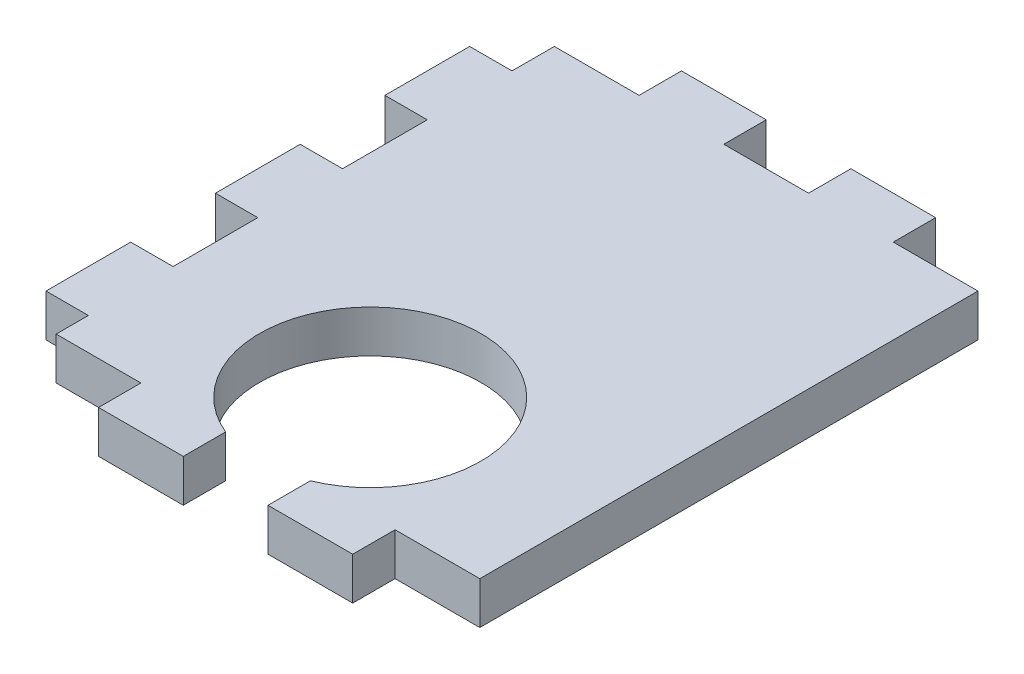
ISO-10303-21;
HEADER;
FILE_DESCRIPTION(('STEP AP214'),'2;1');
FILE_NAME('part.step','',(''),(''),'','','');
FILE_SCHEMA(('AUTOMOTIVE_DESIGN { 1 0 10303 214 1 1 1 1 }'));
ENDSEC;
DATA;
#1=APPLICATION_CONTEXT('core data for automotive mechanical design processes');
#2=APPLICATION_PROTOCOL_DEFINITION('international standard','automotive_design',2000,#1);
#3=PRODUCT_CONTEXT('',#1,'mechanical');
#4=PRODUCT('Part','Part','',(#3));
#5=PRODUCT_RELATED_PRODUCT_CATEGORY('part','',(#4));
#6=PRODUCT_DEFINITION_FORMATION('','',#4);
#7=PRODUCT_DEFINITION_CONTEXT('part definition',#1,'design');
#8=PRODUCT_DEFINITION('design','',#6,#7);
#9=PRODUCT_DEFINITION_SHAPE('','',#8);
#10=(LENGTH_UNIT() NAMED_UNIT(*) SI_UNIT(.MILLI.,.METRE.));
#11=(NAMED_UNIT(*) PLANE_ANGLE_UNIT() SI_UNIT($,.RADIAN.));
#12=(NAMED_UNIT(*) SI_UNIT($,.STERADIAN.) SOLID_ANGLE_UNIT());
#13=UNCERTAINTY_MEASURE_WITH_UNIT(LENGTH_MEASURE(1.E-05),#10,'distance_accuracy_value','');
#14=(GEOMETRIC_REPRESENTATION_CONTEXT(3) GLOBAL_UNCERTAINTY_ASSIGNED_CONTEXT((#13)) GLOBAL_UNIT_ASSIGNED_CONTEXT((#10,
#11,#12)) REPRESENTATION_CONTEXT('',''));
#15=CARTESIAN_POINT('',(0.,0.,0.));
#16=DIRECTION('',(0.,0.,1.));
#17=DIRECTION('',(1.,0.,0.));
#18=AXIS2_PLACEMENT_3D('',#15,#16,#17);
#19=CARTESIAN_POINT('',(0.,3.175,0.));
#20=DIRECTION('',(0.,-1.,0.));
#21=DIRECTION('',(0.,0.,-1.));
#22=AXIS2_PLACEMENT_3D('',#19,#20,#21);
#23=PLANE('',#22);
#24=CARTESIAN_POINT('',(19.05,3.175,-10.8366787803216));
#25=DIRECTION('',(0.,1.,0.));
#26=DIRECTION('',(0.,0.,1.));
#27=AXIS2_PLACEMENT_3D('',#24,#25,#26);
#28=CIRCLE('',#27,8.29348821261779);
#29=CARTESIAN_POINT('',(15.875,3.175,-3.175));
#30=VERTEX_POINT('',#29);
#31=CARTESIAN_POINT('',(22.225,3.175,-3.175));
#32=VERTEX_POINT('',#31);
#33=EDGE_CURVE('E42',#30,#32,#28,.F.);
#34=ORIENTED_EDGE('',*,*,#33,.T.);
#35=DIRECTION('',(0.,0.,-1.));
#36=VECTOR('',#35,1.);
#37=CARTESIAN_POINT('',(22.225,3.175,0.));
#38=LINE('',#37,#36);
#39=CARTESIAN_POINT('',(22.225,3.175,0.));
#40=VERTEX_POINT('',#39);
#41=EDGE_CURVE('E187',#40,#32,#38,.T.);
#42=ORIENTED_EDGE('',*,*,#41,.F.);
#43=DIRECTION('',(1.,0.,0.));
#44=VECTOR('',#43,1.);
#45=CARTESIAN_POINT('',(0.,3.175,0.));
#46=LINE('',#45,#44);
#47=CARTESIAN_POINT('',(28.575,3.175,0.));
#48=VERTEX_POINT('',#47);
#49=EDGE_CURVE('E232',#40,#48,#46,.T.);
#50=ORIENTED_EDGE('',*,*,#49,.T.);
#51=DIRECTION('',(0.,0.,1.));
#52=VECTOR('',#51,1.);
#53=CARTESIAN_POINT('',(28.575,3.175,0.));
#54=LINE('',#53,#52);
#55=CARTESIAN_POINT('',(28.575,3.175,-3.175));
#56=VERTEX_POINT('',#55);
#57=EDGE_CURVE('E209',#56,#48,#54,.T.);
#58=ORIENTED_EDGE('',*,*,#57,.F.);
#59=DIRECTION('',(-1.,0.,0.));
#60=VECTOR('',#59,1.);
#61=CARTESIAN_POINT('',(28.575,3.175,-3.175));
#62=LINE('',#61,#60);
#63=CARTESIAN_POINT('',(34.925,3.175,-3.175));
#64=VERTEX_POINT('',#63);
#65=EDGE_CURVE('E214',#64,#56,#62,.T.);
#66=ORIENTED_EDGE('',*,*,#65,.F.);
#67=DIRECTION('',(0.,0.,-1.));
#68=VECTOR('',#67,1.);
#69=CARTESIAN_POINT('',(34.925,3.175,0.));
#70=LINE('',#69,#68);
#71=CARTESIAN_POINT('',(34.925,3.175,-40.513));
#72=VERTEX_POINT('',#71);
#73=EDGE_CURVE('E227',#64,#72,#70,.T.);
#74=ORIENTED_EDGE('',*,*,#73,.T.);
#75=DIRECTION('',(1.,0.,0.));
#76=VECTOR('',#75,1.);
#77=CARTESIAN_POINT('',(28.575,3.175,-40.513));
#78=LINE('',#77,#76);
#79=CARTESIAN_POINT('',(28.575,3.175,-40.513));
#80=VERTEX_POINT('',#79);
#81=EDGE_CURVE('E197',#80,#72,#78,.T.);
#82=ORIENTED_EDGE('',*,*,#81,.F.);
#83=DIRECTION('',(0.,0.,1.));
#84=VECTOR('',#83,1.);
#85=CARTESIAN_POINT('',(28.575,3.175,-43.688));
#86=LINE('',#85,#84);
#87=CARTESIAN_POINT('',(28.575,3.175,-43.688));
#88=VERTEX_POINT('',#87);
#89=EDGE_CURVE('E184',#88,#80,#86,.T.);
#90=ORIENTED_EDGE('',*,*,#89,.F.);
#91=DIRECTION('',(-1.,0.,0.));
#92=VECTOR('',#91,1.);
#93=CARTESIAN_POINT('',(0.,3.175,-43.688));
#94=LINE('',#93,#92);
#95=CARTESIAN_POINT('',(22.225,3.175,-43.688));
#96=VERTEX_POINT('',#95);
#97=EDGE_CURVE('E12',#88,#96,#94,.T.);
#98=ORIENTED_EDGE('',*,*,#97,.T.);
#99=DIRECTION('',(0.,0.,-1.));
#100=VECTOR('',#99,1.);
#101=CARTESIAN_POINT('',(22.225,3.175,-43.688));
#102=LINE('',#101,#100);
#103=CARTESIAN_POINT('',(22.225,3.175,-40.513));
#104=VERTEX_POINT('',#103);
#105=EDGE_CURVE('E398',#104,#96,#102,.T.);
#106=ORIENTED_EDGE('',*,*,#105,.F.);
#107=DIRECTION('',(1.,0.,0.));
#108=VECTOR('',#107,1.);
#109=CARTESIAN_POINT('',(15.875,3.175,-40.513));
#110=LINE('',#109,#108);
#111=CARTESIAN_POINT('',(15.875,3.175,-40.513));
#112=VERTEX_POINT('',#111);
#113=EDGE_CURVE('E404',#112,#104,#110,.T.);
#114=ORIENTED_EDGE('',*,*,#113,.F.);
#115=DIRECTION('',(0.,0.,1.));
#116=VECTOR('',#115,1.);
#117=CARTESIAN_POINT('',(15.875,3.175,-43.688));
#118=LINE('',#117,#116);
#119=CARTESIAN_POINT('',(15.875,3.175,-43.688));
#120=VERTEX_POINT('',#119);
#121=EDGE_CURVE('E378',#120,#112,#118,.T.);
#122=ORIENTED_EDGE('',*,*,#121,.F.);
#123=CARTESIAN_POINT('',(9.52499999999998,3.175,-43.688));
#124=VERTEX_POINT('',#123);
#125=EDGE_CURVE('E48',#120,#124,#94,.T.);
#126=ORIENTED_EDGE('',*,*,#125,.T.);
#127=DIRECTION('',(0.,0.,-1.));
#128=VECTOR('',#127,1.);
#129=CARTESIAN_POINT('',(9.52499999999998,3.175,-43.688));
#130=LINE('',#129,#128);
#131=CARTESIAN_POINT('',(9.52499999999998,3.175,-40.513));
#132=VERTEX_POINT('',#131);
#133=EDGE_CURVE('E251',#132,#124,#130,.T.);
#134=ORIENTED_EDGE('',*,*,#133,.F.);
#135=DIRECTION('',(1.,0.,0.));
#136=VECTOR('',#135,1.);
#137=CARTESIAN_POINT('',(3.175,3.175,-40.513));
#138=LINE('',#137,#136);
#139=CARTESIAN_POINT('',(3.175,3.175,-40.513));
#140=VERTEX_POINT('',#139);
#141=EDGE_CURVE('E257',#140,#132,#138,.T.);
#142=ORIENTED_EDGE('',*,*,#141,.F.);
#143=DIRECTION('',(0.,0.,1.));
#144=VECTOR('',#143,1.);
#145=CARTESIAN_POINT('',(3.1750000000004,3.175,0.));
#146=LINE('',#145,#144);
#147=CARTESIAN_POINT('',(3.17500000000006,3.175,-37.338));
#148=VERTEX_POINT('',#147);
#149=EDGE_CURVE('E345',#140,#148,#146,.T.);
#150=ORIENTED_EDGE('',*,*,#149,.T.);
#151=DIRECTION('',(1.,0.,0.));
#152=VECTOR('',#151,1.);
#153=CARTESIAN_POINT('',(0.,3.175,-37.338));
#154=LINE('',#153,#152);
#155=CARTESIAN_POINT('',(0.,3.175,-37.338));
#156=VERTEX_POINT('',#155);
#157=EDGE_CURVE('E352',#156,#148,#154,.T.);
#158=ORIENTED_EDGE('',*,*,#157,.F.);
#159=DIRECTION('',(0.,0.,1.));
#160=VECTOR('',#159,1.);
#161=CARTESIAN_POINT('',(0.,3.175,0.));
#162=LINE('',#161,#160);
#163=CARTESIAN_POINT('',(0.,3.175,-30.988));
#164=VERTEX_POINT('',#163);
#165=EDGE_CURVE('E276',#156,#164,#162,.T.);
#166=ORIENTED_EDGE('',*,*,#165,.T.);
#167=DIRECTION('',(1.,0.,0.));
#168=VECTOR('',#167,1.);
#169=CARTESIAN_POINT('',(0.,3.175,-30.988));
#170=LINE('',#169,#168);
#171=CARTESIAN_POINT('',(3.17500000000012,3.175,-30.988));
#172=VERTEX_POINT('',#171);
#173=EDGE_CURVE('E563',#164,#172,#170,.T.);
#174=ORIENTED_EDGE('',*,*,#173,.T.);
#175=DIRECTION('',(0.,0.,1.));
#176=VECTOR('',#175,1.);
#177=CARTESIAN_POINT('',(3.1750000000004,3.175,0.));
#178=LINE('',#177,#176);
#179=CARTESIAN_POINT('',(3.17500000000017,3.175,-24.638));
#180=VERTEX_POINT('',#179);
#181=EDGE_CURVE('E568',#172,#180,#178,.T.);
#182=ORIENTED_EDGE('',*,*,#181,.T.);
#183=DIRECTION('',(1.,0.,0.));
#184=VECTOR('',#183,1.);
#185=CARTESIAN_POINT('',(0.,3.175,-24.638));
#186=LINE('',#185,#184);
#187=CARTESIAN_POINT('',(0.,3.175,-24.638));
#188=VERTEX_POINT('',#187);
#189=EDGE_CURVE('E573',#188,#180,#186,.T.);
#190=ORIENTED_EDGE('',*,*,#189,.F.);
#191=CARTESIAN_POINT('',(0.,3.175,-18.288));
#192=VERTEX_POINT('',#191);
#193=EDGE_CURVE('E280',#188,#192,#162,.T.);
#194=ORIENTED_EDGE('',*,*,#193,.T.);
#195=DIRECTION('',(1.,0.,0.));
#196=VECTOR('',#195,1.);
#197=CARTESIAN_POINT('',(0.,3.175,-18.288));
#198=LINE('',#197,#196);
#199=CARTESIAN_POINT('',(3.17500000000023,3.175,-18.288));
#200=VERTEX_POINT('',#199);
#201=EDGE_CURVE('E297',#192,#200,#198,.T.);
#202=ORIENTED_EDGE('',*,*,#201,.T.);
#203=DIRECTION('',(0.,0.,1.));
#204=VECTOR('',#203,1.);
#205=CARTESIAN_POINT('',(3.1750000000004,3.175,0.));
#206=LINE('',#205,#204);
#207=CARTESIAN_POINT('',(3.17500000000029,3.175,-11.938));
#208=VERTEX_POINT('',#207);
#209=EDGE_CURVE('E305',#200,#208,#206,.T.);
#210=ORIENTED_EDGE('',*,*,#209,.T.);
#211=DIRECTION('',(1.,0.,0.));
#212=VECTOR('',#211,1.);
#213=CARTESIAN_POINT('',(0.,3.175,-11.938));
#214=LINE('',#213,#212);
#215=CARTESIAN_POINT('',(0.,3.175,-11.938));
#216=VERTEX_POINT('',#215);
#217=EDGE_CURVE('E311',#216,#208,#214,.T.);
#218=ORIENTED_EDGE('',*,*,#217,.F.);
#219=CARTESIAN_POINT('',(0.,3.175,-5.58800000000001));
#220=VERTEX_POINT('',#219);
#221=EDGE_CURVE('E281',#216,#220,#162,.T.);
#222=ORIENTED_EDGE('',*,*,#221,.T.);
#223=DIRECTION('',(1.,0.,0.));
#224=VECTOR('',#223,1.);
#225=CARTESIAN_POINT('',(0.,3.175,-5.588));
#226=LINE('',#225,#224);
#227=CARTESIAN_POINT('',(3.17500000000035,3.175,-5.58800000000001));
#228=VERTEX_POINT('',#227);
#229=EDGE_CURVE('E324',#220,#228,#226,.T.);
#230=ORIENTED_EDGE('',*,*,#229,.T.);
#231=DIRECTION('',(0.,0.,-1.));
#232=VECTOR('',#231,1.);
#233=CARTESIAN_POINT('',(3.17499999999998,3.175,0.));
#234=LINE('',#233,#232);
#235=CARTESIAN_POINT('',(3.175,3.175,-3.175));
#236=VERTEX_POINT('',#235);
#237=EDGE_CURVE('E331',#236,#228,#234,.T.);
#238=ORIENTED_EDGE('',*,*,#237,.F.);
#239=DIRECTION('',(-1.,0.,0.));
#240=VECTOR('',#239,1.);
#241=CARTESIAN_POINT('',(3.175,3.175,-3.175));
#242=LINE('',#241,#240);
#243=CARTESIAN_POINT('',(9.52499999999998,3.175,-3.175));
#244=VERTEX_POINT('',#243);
#245=EDGE_CURVE('E429',#244,#236,#242,.T.);
#246=ORIENTED_EDGE('',*,*,#245,.F.);
#247=DIRECTION('',(0.,0.,-1.));
#248=VECTOR('',#247,1.);
#249=CARTESIAN_POINT('',(9.52499999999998,3.175,0.));
#250=LINE('',#249,#248);
#251=CARTESIAN_POINT('',(9.52499999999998,3.175,0.));
#252=VERTEX_POINT('',#251);
#253=EDGE_CURVE('E428',#252,#244,#250,.T.);
#254=ORIENTED_EDGE('',*,*,#253,.F.);
#255=CARTESIAN_POINT('',(15.875,3.175,0.));
#256=VERTEX_POINT('',#255);
#257=EDGE_CURVE('E231',#252,#256,#46,.T.);
#258=ORIENTED_EDGE('',*,*,#257,.T.);
#259=DIRECTION('',(0.,0.,1.));
#260=VECTOR('',#259,1.);
#261=CARTESIAN_POINT('',(15.875,3.175,0.));
#262=LINE('',#261,#260);
#263=EDGE_CURVE('E369',#30,#256,#262,.T.);
#264=ORIENTED_EDGE('',*,*,#263,.F.);
#265=EDGE_LOOP('',(#34,#42,#50,#58,#66,#74,#82,#90,#98,#106,#114,#122,#126,#134,#142,#150,#158,
#166,#174,#182,#190,#194,#202,#210,#218,#222,#230,#238,#246,#254,#258,#264));
#266=FACE_BOUND('',#265,.T.);
#267=ADVANCED_FACE('F38',(#266),#23,.F.);
#268=CARTESIAN_POINT('',(0.,0.,0.));
#269=DIRECTION('',(0.,-1.,0.));
#270=DIRECTION('',(0.,0.,-1.));
#271=AXIS2_PLACEMENT_3D('',#268,#269,#270);
#272=PLANE('',#271);
#273=DIRECTION('',(0.,0.,-1.));
#274=VECTOR('',#273,1.);
#275=CARTESIAN_POINT('',(22.225,0.,0.));
#276=LINE('',#275,#274);
#277=CARTESIAN_POINT('',(22.225,0.,0.));
#278=VERTEX_POINT('',#277);
#279=CARTESIAN_POINT('',(22.225,0.,-3.175));
#280=VERTEX_POINT('',#279);
#281=EDGE_CURVE('E82',#278,#280,#276,.T.);
#282=ORIENTED_EDGE('',*,*,#281,.T.);
#283=CARTESIAN_POINT('',(19.05,0.,-10.8366787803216));
#284=DIRECTION('',(0.,1.,0.));
#285=DIRECTION('',(0.,0.,1.));
#286=AXIS2_PLACEMENT_3D('',#283,#284,#285);
#287=CIRCLE('',#286,8.29348821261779);
#288=CARTESIAN_POINT('',(15.875,0.,-3.175));
#289=VERTEX_POINT('',#288);
#290=EDGE_CURVE('E612',#289,#280,#287,.F.);
#291=ORIENTED_EDGE('',*,*,#290,.F.);
#292=DIRECTION('',(0.,0.,1.));
#293=VECTOR('',#292,1.);
#294=CARTESIAN_POINT('',(15.875,0.,0.));
#295=LINE('',#294,#293);
#296=CARTESIAN_POINT('',(15.875,0.,0.));
#297=VERTEX_POINT('',#296);
#298=EDGE_CURVE('E370',#289,#297,#295,.T.);
#299=ORIENTED_EDGE('',*,*,#298,.T.);
#300=DIRECTION('',(1.,0.,0.));
#301=VECTOR('',#300,1.);
#302=CARTESIAN_POINT('',(0.,0.,0.));
#303=LINE('',#302,#301);
#304=CARTESIAN_POINT('',(9.52499999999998,0.,0.));
#305=VERTEX_POINT('',#304);
#306=EDGE_CURVE('E488',#305,#297,#303,.T.);
#307=ORIENTED_EDGE('',*,*,#306,.F.);
#308=DIRECTION('',(0.,0.,-1.));
#309=VECTOR('',#308,1.);
#310=CARTESIAN_POINT('',(9.52499999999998,0.,0.));
#311=LINE('',#310,#309);
#312=CARTESIAN_POINT('',(9.52499999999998,0.,-3.175));
#313=VERTEX_POINT('',#312);
#314=EDGE_CURVE('E434',#305,#313,#311,.T.);
#315=ORIENTED_EDGE('',*,*,#314,.T.);
#316=DIRECTION('',(-1.,0.,0.));
#317=VECTOR('',#316,1.);
#318=CARTESIAN_POINT('',(3.175,0.,-3.175));
#319=LINE('',#318,#317);
#320=CARTESIAN_POINT('',(3.175,0.,-3.175));
#321=VERTEX_POINT('',#320);
#322=EDGE_CURVE('E443',#313,#321,#319,.T.);
#323=ORIENTED_EDGE('',*,*,#322,.T.);
#324=DIRECTION('',(0.,0.,-1.));
#325=VECTOR('',#324,1.);
#326=CARTESIAN_POINT('',(3.17499999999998,0.,0.));
#327=LINE('',#326,#325);
#328=CARTESIAN_POINT('',(3.17500000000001,0.,-5.58800000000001));
#329=VERTEX_POINT('',#328);
#330=EDGE_CURVE('E337',#321,#329,#327,.T.);
#331=ORIENTED_EDGE('',*,*,#330,.T.);
#332=DIRECTION('',(1.,0.,0.));
#333=VECTOR('',#332,1.);
#334=CARTESIAN_POINT('',(0.,0.,-5.588));
#335=LINE('',#334,#333);
#336=CARTESIAN_POINT('',(0.,0.,-5.58800000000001));
#337=VERTEX_POINT('',#336);
#338=EDGE_CURVE('E334',#337,#329,#335,.T.);
#339=ORIENTED_EDGE('',*,*,#338,.F.);
#340=DIRECTION('',(0.,0.,1.));
#341=VECTOR('',#340,1.);
#342=CARTESIAN_POINT('',(0.,0.,0.));
#343=LINE('',#342,#341);
#344=CARTESIAN_POINT('',(0.,0.,-11.938));
#345=VERTEX_POINT('',#344);
#346=EDGE_CURVE('E275',#345,#337,#343,.T.);
#347=ORIENTED_EDGE('',*,*,#346,.F.);
#348=DIRECTION('',(1.,0.,0.));
#349=VECTOR('',#348,1.);
#350=CARTESIAN_POINT('',(0.,0.,-11.938));
#351=LINE('',#350,#349);
#352=CARTESIAN_POINT('',(3.17500000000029,0.,-11.938));
#353=VERTEX_POINT('',#352);
#354=EDGE_CURVE('E316',#345,#353,#351,.T.);
#355=ORIENTED_EDGE('',*,*,#354,.T.);
#356=DIRECTION('',(0.,0.,1.));
#357=VECTOR('',#356,1.);
#358=CARTESIAN_POINT('',(3.1750000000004,0.,0.));
#359=LINE('',#358,#357);
#360=CARTESIAN_POINT('',(3.17500000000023,0.,-18.288));
#361=VERTEX_POINT('',#360);
#362=EDGE_CURVE('E317',#361,#353,#359,.T.);
#363=ORIENTED_EDGE('',*,*,#362,.F.);
#364=DIRECTION('',(1.,0.,0.));
#365=VECTOR('',#364,1.);
#366=CARTESIAN_POINT('',(0.,0.,-18.288));
#367=LINE('',#366,#365);
#368=CARTESIAN_POINT('',(0.,0.,-18.288));
#369=VERTEX_POINT('',#368);
#370=EDGE_CURVE('E329',#369,#361,#367,.T.);
#371=ORIENTED_EDGE('',*,*,#370,.F.);
#372=CARTESIAN_POINT('',(0.,0.,-24.638));
#373=VERTEX_POINT('',#372);
#374=EDGE_CURVE('E493',#373,#369,#343,.T.);
#375=ORIENTED_EDGE('',*,*,#374,.F.);
#376=DIRECTION('',(1.,0.,0.));
#377=VECTOR('',#376,1.);
#378=CARTESIAN_POINT('',(0.,0.,-24.638));
#379=LINE('',#378,#377);
#380=CARTESIAN_POINT('',(3.17500000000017,0.,-24.638));
#381=VERTEX_POINT('',#380);
#382=EDGE_CURVE('E576',#373,#381,#379,.T.);
#383=ORIENTED_EDGE('',*,*,#382,.T.);
#384=DIRECTION('',(0.,0.,1.));
#385=VECTOR('',#384,1.);
#386=CARTESIAN_POINT('',(3.1750000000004,0.,0.));
#387=LINE('',#386,#385);
#388=CARTESIAN_POINT('',(3.17500000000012,0.,-30.988));
#389=VERTEX_POINT('',#388);
#390=EDGE_CURVE('E577',#389,#381,#387,.T.);
#391=ORIENTED_EDGE('',*,*,#390,.F.);
#392=DIRECTION('',(1.,0.,0.));
#393=VECTOR('',#392,1.);
#394=CARTESIAN_POINT('',(0.,0.,-30.988));
#395=LINE('',#394,#393);
#396=CARTESIAN_POINT('',(0.,0.,-30.988));
#397=VERTEX_POINT('',#396);
#398=EDGE_CURVE('E957',#397,#389,#395,.T.);
#399=ORIENTED_EDGE('',*,*,#398,.F.);
#400=CARTESIAN_POINT('',(0.,0.,-37.338));
#401=VERTEX_POINT('',#400);
#402=EDGE_CURVE('E237',#401,#397,#343,.T.);
#403=ORIENTED_EDGE('',*,*,#402,.F.);
#404=DIRECTION('',(1.,0.,0.));
#405=VECTOR('',#404,1.);
#406=CARTESIAN_POINT('',(0.,0.,-37.338));
#407=LINE('',#406,#405);
#408=CARTESIAN_POINT('',(3.17500000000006,0.,-37.338));
#409=VERTEX_POINT('',#408);
#410=EDGE_CURVE('E357',#401,#409,#407,.T.);
#411=ORIENTED_EDGE('',*,*,#410,.T.);
#412=DIRECTION('',(0.,0.,1.));
#413=VECTOR('',#412,1.);
#414=CARTESIAN_POINT('',(3.1750000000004,0.,0.));
#415=LINE('',#414,#413);
#416=CARTESIAN_POINT('',(3.17500000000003,0.,-40.513));
#417=VERTEX_POINT('',#416);
#418=EDGE_CURVE('E358',#417,#409,#415,.T.);
#419=ORIENTED_EDGE('',*,*,#418,.F.);
#420=DIRECTION('',(1.,0.,0.));
#421=VECTOR('',#420,1.);
#422=CARTESIAN_POINT('',(3.175,0.,-40.513));
#423=LINE('',#422,#421);
#424=CARTESIAN_POINT('',(9.52499999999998,0.,-40.513));
#425=VERTEX_POINT('',#424);
#426=EDGE_CURVE('E256',#417,#425,#423,.T.);
#427=ORIENTED_EDGE('',*,*,#426,.T.);
#428=DIRECTION('',(0.,0.,-1.));
#429=VECTOR('',#428,1.);
#430=CARTESIAN_POINT('',(9.52499999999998,0.,-43.688));
#431=LINE('',#430,#429);
#432=CARTESIAN_POINT('',(9.52499999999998,0.,-43.688));
#433=VERTEX_POINT('',#432);
#434=EDGE_CURVE('E265',#425,#433,#431,.T.);
#435=ORIENTED_EDGE('',*,*,#434,.T.);
#436=DIRECTION('',(-1.,0.,0.));
#437=VECTOR('',#436,1.);
#438=CARTESIAN_POINT('',(0.,0.,-43.688));
#439=LINE('',#438,#437);
#440=CARTESIAN_POINT('',(15.875,0.,-43.688));
#441=VERTEX_POINT('',#440);
#442=EDGE_CURVE('E486',#441,#433,#439,.T.);
#443=ORIENTED_EDGE('',*,*,#442,.F.);
#444=DIRECTION('',(0.,0.,1.));
#445=VECTOR('',#444,1.);
#446=CARTESIAN_POINT('',(15.875,0.,-43.688));
#447=LINE('',#446,#445);
#448=CARTESIAN_POINT('',(15.875,0.,-40.513));
#449=VERTEX_POINT('',#448);
#450=EDGE_CURVE('E415',#441,#449,#447,.T.);
#451=ORIENTED_EDGE('',*,*,#450,.T.);
#452=DIRECTION('',(1.,0.,0.));
#453=VECTOR('',#452,1.);
#454=CARTESIAN_POINT('',(15.875,0.,-40.513));
#455=LINE('',#454,#453);
#456=CARTESIAN_POINT('',(22.225,0.,-40.513));
#457=VERTEX_POINT('',#456);
#458=EDGE_CURVE('E403',#449,#457,#455,.T.);
#459=ORIENTED_EDGE('',*,*,#458,.T.);
#460=DIRECTION('',(0.,0.,-1.));
#461=VECTOR('',#460,1.);
#462=CARTESIAN_POINT('',(22.225,0.,-43.688));
#463=LINE('',#462,#461);
#464=CARTESIAN_POINT('',(22.225,0.,-43.688));
#465=VERTEX_POINT('',#464);
#466=EDGE_CURVE('E420',#457,#465,#463,.T.);
#467=ORIENTED_EDGE('',*,*,#466,.T.);
#468=CARTESIAN_POINT('',(28.575,0.,-43.688));
#469=VERTEX_POINT('',#468);
#470=EDGE_CURVE('E202',#469,#465,#439,.T.);
#471=ORIENTED_EDGE('',*,*,#470,.F.);
#472=DIRECTION('',(0.,0.,1.));
#473=VECTOR('',#472,1.);
#474=CARTESIAN_POINT('',(28.575,0.,-43.688));
#475=LINE('',#474,#473);
#476=CARTESIAN_POINT('',(28.575,0.,-40.513));
#477=VERTEX_POINT('',#476);
#478=EDGE_CURVE('E181',#469,#477,#475,.T.);
#479=ORIENTED_EDGE('',*,*,#478,.T.);
#480=DIRECTION('',(1.,0.,0.));
#481=VECTOR('',#480,1.);
#482=CARTESIAN_POINT('',(28.575,0.,-40.513));
#483=LINE('',#482,#481);
#484=CARTESIAN_POINT('',(34.925,0.,-40.513));
#485=VERTEX_POINT('',#484);
#486=EDGE_CURVE('E190',#477,#485,#483,.T.);
#487=ORIENTED_EDGE('',*,*,#486,.T.);
#488=DIRECTION('',(0.,0.,-1.));
#489=VECTOR('',#488,1.);
#490=CARTESIAN_POINT('',(34.925,0.,0.));
#491=LINE('',#490,#489);
#492=CARTESIAN_POINT('',(34.925,0.,-3.175));
#493=VERTEX_POINT('',#492);
#494=EDGE_CURVE('E487',#493,#485,#491,.T.);
#495=ORIENTED_EDGE('',*,*,#494,.F.);
#496=DIRECTION('',(-1.,0.,0.));
#497=VECTOR('',#496,1.);
#498=CARTESIAN_POINT('',(28.575,0.,-3.175));
#499=LINE('',#498,#497);
#500=CARTESIAN_POINT('',(28.575,0.,-3.175));
#501=VERTEX_POINT('',#500);
#502=EDGE_CURVE('E395',#493,#501,#499,.T.);
#503=ORIENTED_EDGE('',*,*,#502,.T.);
#504=DIRECTION('',(0.,0.,1.));
#505=VECTOR('',#504,1.);
#506=CARTESIAN_POINT('',(28.575,0.,0.));
#507=LINE('',#506,#505);
#508=CARTESIAN_POINT('',(28.575,0.,0.));
#509=VERTEX_POINT('',#508);
#510=EDGE_CURVE('E385',#501,#509,#507,.T.);
#511=ORIENTED_EDGE('',*,*,#510,.T.);
#512=EDGE_CURVE('E489',#278,#509,#303,.T.);
#513=ORIENTED_EDGE('',*,*,#512,.F.);
#514=EDGE_LOOP('',(#282,#291,#299,#307,#315,#323,#331,#339,#347,#355,#363,#371,#375,#383,#391,
#399,#403,#411,#419,#427,#435,#443,#451,#459,#467,#471,#479,#487,#495,#503,#511,#513));
#515=FACE_BOUND('',#514,.T.);
#516=ADVANCED_FACE('F200',(#515),#272,.T.);
#517=CARTESIAN_POINT('',(0.,3.175,0.));
#518=DIRECTION('',(1.,0.,0.));
#519=DIRECTION('',(0.,0.,-1.));
#520=AXIS2_PLACEMENT_3D('',#517,#518,#519);
#521=PLANE('',#520);
#522=DIRECTION('',(0.,1.,0.));
#523=VECTOR('',#522,1.);
#524=CARTESIAN_POINT('',(0.,-7.09951582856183,-30.988));
#525=LINE('',#524,#523);
#526=EDGE_CURVE('E566',#397,#164,#525,.T.);
#527=ORIENTED_EDGE('',*,*,#526,.T.);
#528=ORIENTED_EDGE('',*,*,#165,.F.);
#529=DIRECTION('',(0.,1.,0.));
#530=VECTOR('',#529,1.);
#531=CARTESIAN_POINT('',(0.,-7.09951582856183,-37.338));
#532=LINE('',#531,#530);
#533=EDGE_CURVE('E350',#401,#156,#532,.T.);
#534=ORIENTED_EDGE('',*,*,#533,.F.);
#535=ORIENTED_EDGE('',*,*,#402,.T.);
#536=EDGE_LOOP('',(#527,#528,#534,#535));
#537=FACE_BOUND('',#536,.T.);
#538=ADVANCED_FACE('F40',(#537),#521,.F.);
#539=ORIENTED_EDGE('',*,*,#193,.F.);
#540=DIRECTION('',(0.,1.,0.));
#541=VECTOR('',#540,1.);
#542=CARTESIAN_POINT('',(0.,-7.09951582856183,-24.638));
#543=LINE('',#542,#541);
#544=EDGE_CURVE('E303',#373,#188,#543,.T.);
#545=ORIENTED_EDGE('',*,*,#544,.F.);
#546=ORIENTED_EDGE('',*,*,#374,.T.);
#547=DIRECTION('',(0.,1.,0.));
#548=VECTOR('',#547,1.);
#549=CARTESIAN_POINT('',(0.,-7.09951582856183,-18.288));
#550=LINE('',#549,#548);
#551=EDGE_CURVE('E57',#369,#192,#550,.T.);
#552=ORIENTED_EDGE('',*,*,#551,.T.);
#553=EDGE_LOOP('',(#539,#545,#546,#552));
#554=FACE_BOUND('',#553,.T.);
#555=ADVANCED_FACE('F755',(#554),#521,.F.);
#556=ORIENTED_EDGE('',*,*,#221,.F.);
#557=DIRECTION('',(0.,1.,0.));
#558=VECTOR('',#557,1.);
#559=CARTESIAN_POINT('',(0.,-7.09951582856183,-11.938));
#560=LINE('',#559,#558);
#561=EDGE_CURVE('E302',#345,#216,#560,.T.);
#562=ORIENTED_EDGE('',*,*,#561,.F.);
#563=ORIENTED_EDGE('',*,*,#346,.T.);
#564=DIRECTION('',(0.,1.,0.));
#565=VECTOR('',#564,1.);
#566=CARTESIAN_POINT('',(0.,-7.09951582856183,-5.58800000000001));
#567=LINE('',#566,#565);
#568=EDGE_CURVE('E330',#337,#220,#567,.T.);
#569=ORIENTED_EDGE('',*,*,#568,.T.);
#570=EDGE_LOOP('',(#556,#562,#563,#569));
#571=FACE_BOUND('',#570,.T.);
#572=ADVANCED_FACE('F505',(#571),#521,.F.);
#573=CARTESIAN_POINT('',(0.,3.175,0.));
#574=DIRECTION('',(0.,0.,-1.));
#575=DIRECTION('',(-1.,0.,0.));
#576=AXIS2_PLACEMENT_3D('',#573,#574,#575);
#577=PLANE('',#576);
#578=ORIENTED_EDGE('',*,*,#49,.F.);
#579=DIRECTION('',(0.,1.,0.));
#580=VECTOR('',#579,1.);
#581=CARTESIAN_POINT('',(22.225,-7.09951582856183,0.));
#582=LINE('',#581,#580);
#583=EDGE_CURVE('E377',#278,#40,#582,.T.);
#584=ORIENTED_EDGE('',*,*,#583,.F.);
#585=ORIENTED_EDGE('',*,*,#512,.T.);
#586=DIRECTION('',(0.,1.,0.));
#587=VECTOR('',#586,1.);
#588=CARTESIAN_POINT('',(28.575,-7.09951582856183,0.));
#589=LINE('',#588,#587);
#590=EDGE_CURVE('E383',#509,#48,#589,.T.);
#591=ORIENTED_EDGE('',*,*,#590,.T.);
#592=EDGE_LOOP('',(#578,#584,#585,#591));
#593=FACE_BOUND('',#592,.T.);
#594=ADVANCED_FACE('F622',(#593),#577,.F.);
#595=CARTESIAN_POINT('',(0.,3.175,-43.688));
#596=DIRECTION('',(0.,0.,1.));
#597=DIRECTION('',(1.,0.,0.));
#598=AXIS2_PLACEMENT_3D('',#595,#596,#597);
#599=PLANE('',#598);
#600=ORIENTED_EDGE('',*,*,#97,.F.);
#601=DIRECTION('',(0.,1.,0.));
#602=VECTOR('',#601,1.);
#603=CARTESIAN_POINT('',(28.575,-7.09951582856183,-43.688));
#604=LINE('',#603,#602);
#605=EDGE_CURVE('E203',#469,#88,#604,.T.);
#606=ORIENTED_EDGE('',*,*,#605,.F.);
#607=ORIENTED_EDGE('',*,*,#470,.T.);
#608=DIRECTION('',(0.,1.,0.));
#609=VECTOR('',#608,1.);
#610=CARTESIAN_POINT('',(22.225,-7.09951582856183,-43.688));
#611=LINE('',#610,#609);
#612=EDGE_CURVE('E422',#465,#96,#611,.T.);
#613=ORIENTED_EDGE('',*,*,#612,.T.);
#614=EDGE_LOOP('',(#600,#606,#607,#613));
#615=FACE_BOUND('',#614,.T.);
#616=ADVANCED_FACE('F647',(#615),#599,.F.);
#617=ORIENTED_EDGE('',*,*,#306,.T.);
#618=DIRECTION('',(0.,1.,0.));
#619=VECTOR('',#618,1.);
#620=CARTESIAN_POINT('',(15.875,-7.09951582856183,0.));
#621=LINE('',#620,#619);
#622=EDGE_CURVE('E373',#297,#256,#621,.T.);
#623=ORIENTED_EDGE('',*,*,#622,.T.);
#624=ORIENTED_EDGE('',*,*,#257,.F.);
#625=DIRECTION('',(0.,1.,0.));
#626=VECTOR('',#625,1.);
#627=CARTESIAN_POINT('',(9.52499999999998,-7.09951582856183,0.));
#628=LINE('',#627,#626);
#629=EDGE_CURVE('E258',#305,#252,#628,.T.);
#630=ORIENTED_EDGE('',*,*,#629,.F.);
#631=EDGE_LOOP('',(#617,#623,#624,#630));
#632=FACE_BOUND('',#631,.T.);
#633=ADVANCED_FACE('F618',(#632),#577,.F.);
#634=ORIENTED_EDGE('',*,*,#125,.F.);
#635=DIRECTION('',(0.,1.,0.));
#636=VECTOR('',#635,1.);
#637=CARTESIAN_POINT('',(15.875,-7.09951582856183,-43.688));
#638=LINE('',#637,#636);
#639=EDGE_CURVE('E419',#441,#120,#638,.T.);
#640=ORIENTED_EDGE('',*,*,#639,.F.);
#641=ORIENTED_EDGE('',*,*,#442,.T.);
#642=DIRECTION('',(0.,1.,0.));
#643=VECTOR('',#642,1.);
#644=CARTESIAN_POINT('',(9.52499999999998,-7.09951582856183,-43.688));
#645=LINE('',#644,#643);
#646=EDGE_CURVE('E268',#433,#124,#645,.T.);
#647=ORIENTED_EDGE('',*,*,#646,.T.);
#648=EDGE_LOOP('',(#634,#640,#641,#647));
#649=FACE_BOUND('',#648,.T.);
#650=ADVANCED_FACE('F639',(#649),#599,.F.);
#651=CARTESIAN_POINT('',(34.925,3.175,0.));
#652=DIRECTION('',(-1.,0.,0.));
#653=DIRECTION('',(0.,0.,1.));
#654=AXIS2_PLACEMENT_3D('',#651,#652,#653);
#655=PLANE('',#654);
#656=ORIENTED_EDGE('',*,*,#494,.T.);
#657=DIRECTION('',(0.,1.,0.));
#658=VECTOR('',#657,1.);
#659=CARTESIAN_POINT('',(34.925,-7.09951582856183,-40.513));
#660=LINE('',#659,#658);
#661=EDGE_CURVE('E193',#485,#72,#660,.T.);
#662=ORIENTED_EDGE('',*,*,#661,.T.);
#663=ORIENTED_EDGE('',*,*,#73,.F.);
#664=DIRECTION('',(0.,1.,0.));
#665=VECTOR('',#664,1.);
#666=CARTESIAN_POINT('',(34.925,-7.09951582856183,-3.175));
#667=LINE('',#666,#665);
#668=EDGE_CURVE('E213',#493,#64,#667,.T.);
#669=ORIENTED_EDGE('',*,*,#668,.F.);
#670=EDGE_LOOP('',(#656,#662,#663,#669));
#671=FACE_BOUND('',#670,.T.);
#672=ADVANCED_FACE('F637',(#671),#655,.F.);
#673=CARTESIAN_POINT('',(3.175,-7.09951582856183,-40.513));
#674=DIRECTION('',(0.,0.,1.));
#675=DIRECTION('',(1.,0.,0.));
#676=AXIS2_PLACEMENT_3D('',#673,#674,#675);
#677=PLANE('',#676);
#678=DIRECTION('',(0.,1.,0.));
#679=VECTOR('',#678,1.);
#680=CARTESIAN_POINT('',(9.52499999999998,-7.09951582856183,-40.513));
#681=LINE('',#680,#679);
#682=EDGE_CURVE('E264',#425,#132,#681,.T.);
#683=ORIENTED_EDGE('',*,*,#682,.F.);
#684=ORIENTED_EDGE('',*,*,#426,.F.);
#685=DIRECTION('',(0.,1.,0.));
#686=VECTOR('',#685,1.);
#687=CARTESIAN_POINT('',(3.175,-7.09951582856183,-40.513));
#688=LINE('',#687,#686);
#689=EDGE_CURVE('E271',#417,#140,#688,.T.);
#690=ORIENTED_EDGE('',*,*,#689,.T.);
#691=ORIENTED_EDGE('',*,*,#141,.T.);
#692=EDGE_LOOP('',(#683,#684,#690,#691));
#693=FACE_BOUND('',#692,.T.);
#694=ADVANCED_FACE('F551',(#693),#677,.F.);
#695=CARTESIAN_POINT('',(9.52499999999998,-7.09951582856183,-43.688));
#696=DIRECTION('',(1.,0.,0.));
#697=DIRECTION('',(0.,0.,-1.));
#698=AXIS2_PLACEMENT_3D('',#695,#696,#697);
#699=PLANE('',#698);
#700=ORIENTED_EDGE('',*,*,#682,.T.);
#701=ORIENTED_EDGE('',*,*,#133,.T.);
#702=ORIENTED_EDGE('',*,*,#646,.F.);
#703=ORIENTED_EDGE('',*,*,#434,.F.);
#704=EDGE_LOOP('',(#700,#701,#702,#703));
#705=FACE_BOUND('',#704,.T.);
#706=ADVANCED_FACE('F554',(#705),#699,.F.);
#707=CARTESIAN_POINT('',(9.52499999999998,-7.09951582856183,0.));
#708=DIRECTION('',(1.,0.,0.));
#709=DIRECTION('',(0.,0.,-1.));
#710=AXIS2_PLACEMENT_3D('',#707,#708,#709);
#711=PLANE('',#710);
#712=ORIENTED_EDGE('',*,*,#629,.T.);
#713=ORIENTED_EDGE('',*,*,#253,.T.);
#714=DIRECTION('',(0.,1.,0.));
#715=VECTOR('',#714,1.);
#716=CARTESIAN_POINT('',(9.52499999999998,-7.09951582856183,-3.175));
#717=LINE('',#716,#715);
#718=EDGE_CURVE('E442',#313,#244,#717,.T.);
#719=ORIENTED_EDGE('',*,*,#718,.F.);
#720=ORIENTED_EDGE('',*,*,#314,.F.);
#721=EDGE_LOOP('',(#712,#713,#719,#720));
#722=FACE_BOUND('',#721,.T.);
#723=ADVANCED_FACE('F456',(#722),#711,.F.);
#724=CARTESIAN_POINT('',(3.175,-7.09951582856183,-3.175));
#725=DIRECTION('',(0.,0.,-1.));
#726=DIRECTION('',(-1.,0.,0.));
#727=AXIS2_PLACEMENT_3D('',#724,#725,#726);
#728=PLANE('',#727);
#729=ORIENTED_EDGE('',*,*,#245,.T.);
#730=DIRECTION('',(0.,1.,0.));
#731=VECTOR('',#730,1.);
#732=CARTESIAN_POINT('',(3.175,-7.09951582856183,-3.175));
#733=LINE('',#732,#731);
#734=EDGE_CURVE('E446',#321,#236,#733,.T.);
#735=ORIENTED_EDGE('',*,*,#734,.F.);
#736=ORIENTED_EDGE('',*,*,#322,.F.);
#737=ORIENTED_EDGE('',*,*,#718,.T.);
#738=EDGE_LOOP('',(#729,#735,#736,#737));
#739=FACE_BOUND('',#738,.T.);
#740=ADVANCED_FACE('F450',(#739),#728,.F.);
#741=CARTESIAN_POINT('',(15.875,-7.09951582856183,-40.513));
#742=DIRECTION('',(0.,0.,1.));
#743=DIRECTION('',(1.,0.,0.));
#744=AXIS2_PLACEMENT_3D('',#741,#742,#743);
#745=PLANE('',#744);
#746=DIRECTION('',(0.,1.,0.));
#747=VECTOR('',#746,1.);
#748=CARTESIAN_POINT('',(15.875,-7.09951582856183,-40.513));
#749=LINE('',#748,#747);
#750=EDGE_CURVE('E418',#449,#112,#749,.T.);
#751=ORIENTED_EDGE('',*,*,#750,.T.);
#752=ORIENTED_EDGE('',*,*,#113,.T.);
#753=DIRECTION('',(0.,1.,0.));
#754=VECTOR('',#753,1.);
#755=CARTESIAN_POINT('',(22.225,-7.09951582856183,-40.513));
#756=LINE('',#755,#754);
#757=EDGE_CURVE('E414',#457,#104,#756,.T.);
#758=ORIENTED_EDGE('',*,*,#757,.F.);
#759=ORIENTED_EDGE('',*,*,#458,.F.);
#760=EDGE_LOOP('',(#751,#752,#758,#759));
#761=FACE_BOUND('',#760,.T.);
#762=ADVANCED_FACE('F669',(#761),#745,.F.);
#763=CARTESIAN_POINT('',(22.225,-7.09951582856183,-43.688));
#764=DIRECTION('',(1.,0.,0.));
#765=DIRECTION('',(0.,0.,-1.));
#766=AXIS2_PLACEMENT_3D('',#763,#764,#765);
#767=PLANE('',#766);
#768=ORIENTED_EDGE('',*,*,#757,.T.);
#769=ORIENTED_EDGE('',*,*,#105,.T.);
#770=ORIENTED_EDGE('',*,*,#612,.F.);
#771=ORIENTED_EDGE('',*,*,#466,.F.);
#772=EDGE_LOOP('',(#768,#769,#770,#771));
#773=FACE_BOUND('',#772,.T.);
#774=ADVANCED_FACE('F665',(#773),#767,.F.);
#775=CARTESIAN_POINT('',(15.875,-7.09951582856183,-43.688));
#776=DIRECTION('',(-1.,0.,0.));
#777=DIRECTION('',(0.,0.,1.));
#778=AXIS2_PLACEMENT_3D('',#775,#776,#777);
#779=PLANE('',#778);
#780=ORIENTED_EDGE('',*,*,#639,.T.);
#781=ORIENTED_EDGE('',*,*,#121,.T.);
#782=ORIENTED_EDGE('',*,*,#750,.F.);
#783=ORIENTED_EDGE('',*,*,#450,.F.);
#784=EDGE_LOOP('',(#780,#781,#782,#783));
#785=FACE_BOUND('',#784,.T.);
#786=ADVANCED_FACE('F671',(#785),#779,.F.);
#787=CARTESIAN_POINT('',(28.575,-7.09951582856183,-3.175));
#788=DIRECTION('',(0.,0.,-1.));
#789=DIRECTION('',(-1.,0.,0.));
#790=AXIS2_PLACEMENT_3D('',#787,#788,#789);
#791=PLANE('',#790);
#792=ORIENTED_EDGE('',*,*,#668,.T.);
#793=ORIENTED_EDGE('',*,*,#65,.T.);
#794=DIRECTION('',(0.,1.,0.));
#795=VECTOR('',#794,1.);
#796=CARTESIAN_POINT('',(28.575,-7.09951582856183,-3.175));
#797=LINE('',#796,#795);
#798=EDGE_CURVE('E392',#501,#56,#797,.T.);
#799=ORIENTED_EDGE('',*,*,#798,.F.);
#800=ORIENTED_EDGE('',*,*,#502,.F.);
#801=EDGE_LOOP('',(#792,#793,#799,#800));
#802=FACE_BOUND('',#801,.T.);
#803=ADVANCED_FACE('F629',(#802),#791,.F.);
#804=CARTESIAN_POINT('',(28.575,-7.09951582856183,0.));
#805=DIRECTION('',(-1.,0.,0.));
#806=DIRECTION('',(0.,0.,1.));
#807=AXIS2_PLACEMENT_3D('',#804,#805,#806);
#808=PLANE('',#807);
#809=ORIENTED_EDGE('',*,*,#798,.T.);
#810=ORIENTED_EDGE('',*,*,#57,.T.);
#811=ORIENTED_EDGE('',*,*,#590,.F.);
#812=ORIENTED_EDGE('',*,*,#510,.F.);
#813=EDGE_LOOP('',(#809,#810,#811,#812));
#814=FACE_BOUND('',#813,.T.);
#815=ADVANCED_FACE('F626',(#814),#808,.F.);
#816=CARTESIAN_POINT('',(28.575,-7.09951582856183,-40.513));
#817=DIRECTION('',(0.,0.,1.));
#818=DIRECTION('',(1.,0.,0.));
#819=AXIS2_PLACEMENT_3D('',#816,#817,#818);
#820=PLANE('',#819);
#821=DIRECTION('',(0.,1.,0.));
#822=VECTOR('',#821,1.);
#823=CARTESIAN_POINT('',(28.575,-7.09951582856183,-40.513));
#824=LINE('',#823,#822);
#825=EDGE_CURVE('E177',#477,#80,#824,.T.);
#826=ORIENTED_EDGE('',*,*,#825,.T.);
#827=ORIENTED_EDGE('',*,*,#81,.T.);
#828=ORIENTED_EDGE('',*,*,#661,.F.);
#829=ORIENTED_EDGE('',*,*,#486,.F.);
#830=EDGE_LOOP('',(#826,#827,#828,#829));
#831=FACE_BOUND('',#830,.T.);
#832=ADVANCED_FACE('F191',(#831),#820,.F.);
#833=CARTESIAN_POINT('',(28.575,-7.09951582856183,-43.688));
#834=DIRECTION('',(-1.,0.,0.));
#835=DIRECTION('',(0.,0.,1.));
#836=AXIS2_PLACEMENT_3D('',#833,#834,#835);
#837=PLANE('',#836);
#838=ORIENTED_EDGE('',*,*,#605,.T.);
#839=ORIENTED_EDGE('',*,*,#89,.T.);
#840=ORIENTED_EDGE('',*,*,#825,.F.);
#841=ORIENTED_EDGE('',*,*,#478,.F.);
#842=EDGE_LOOP('',(#838,#839,#840,#841));
#843=FACE_BOUND('',#842,.T.);
#844=ADVANCED_FACE('F179',(#843),#837,.F.);
#845=CARTESIAN_POINT('',(22.225,-7.09951582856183,0.));
#846=DIRECTION('',(1.,0.,0.));
#847=DIRECTION('',(0.,0.,-1.));
#848=AXIS2_PLACEMENT_3D('',#845,#846,#847);
#849=PLANE('',#848);
#850=ORIENTED_EDGE('',*,*,#583,.T.);
#851=ORIENTED_EDGE('',*,*,#41,.T.);
#852=DIRECTION('',(0.,1.,0.));
#853=VECTOR('',#852,1.);
#854=CARTESIAN_POINT('',(22.225,-7.09951582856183,-3.175));
#855=LINE('',#854,#853);
#856=EDGE_CURVE('E368',#280,#32,#855,.T.);
#857=ORIENTED_EDGE('',*,*,#856,.F.);
#858=ORIENTED_EDGE('',*,*,#281,.F.);
#859=EDGE_LOOP('',(#850,#851,#857,#858));
#860=FACE_BOUND('',#859,.T.);
#861=ADVANCED_FACE('F621',(#860),#849,.F.);
#862=CARTESIAN_POINT('',(15.875,-7.09951582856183,0.));
#863=DIRECTION('',(-1.,0.,0.));
#864=DIRECTION('',(0.,0.,1.));
#865=AXIS2_PLACEMENT_3D('',#862,#863,#864);
#866=PLANE('',#865);
#867=DIRECTION('',(0.,1.,0.));
#868=VECTOR('',#867,1.);
#869=CARTESIAN_POINT('',(15.875,-7.09951582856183,-3.175));
#870=LINE('',#869,#868);
#871=EDGE_CURVE('E374',#289,#30,#870,.T.);
#872=ORIENTED_EDGE('',*,*,#871,.T.);
#873=ORIENTED_EDGE('',*,*,#263,.T.);
#874=ORIENTED_EDGE('',*,*,#622,.F.);
#875=ORIENTED_EDGE('',*,*,#298,.F.);
#876=EDGE_LOOP('',(#872,#873,#874,#875));
#877=FACE_BOUND('',#876,.T.);
#878=ADVANCED_FACE('F616',(#877),#866,.F.);
#879=CARTESIAN_POINT('',(3.1750000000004,-7.09951582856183,0.));
#880=DIRECTION('',(-1.,0.,0.));
#881=DIRECTION('',(0.,0.,1.));
#882=AXIS2_PLACEMENT_3D('',#879,#880,#881);
#883=PLANE('',#882);
#884=ORIENTED_EDGE('',*,*,#689,.F.);
#885=ORIENTED_EDGE('',*,*,#418,.T.);
#886=DIRECTION('',(0.,1.,0.));
#887=VECTOR('',#886,1.);
#888=CARTESIAN_POINT('',(3.17500000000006,-7.09951582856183,-37.338));
#889=LINE('',#888,#887);
#890=EDGE_CURVE('E351',#409,#148,#889,.T.);
#891=ORIENTED_EDGE('',*,*,#890,.T.);
#892=ORIENTED_EDGE('',*,*,#149,.F.);
#893=EDGE_LOOP('',(#884,#885,#891,#892));
#894=FACE_BOUND('',#893,.T.);
#895=ADVANCED_FACE('F544',(#894),#883,.T.);
#896=CARTESIAN_POINT('',(0.,-7.09951582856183,-37.338));
#897=DIRECTION('',(0.,0.,1.));
#898=DIRECTION('',(1.,0.,0.));
#899=AXIS2_PLACEMENT_3D('',#896,#897,#898);
#900=PLANE('',#899);
#901=ORIENTED_EDGE('',*,*,#533,.T.);
#902=ORIENTED_EDGE('',*,*,#157,.T.);
#903=ORIENTED_EDGE('',*,*,#890,.F.);
#904=ORIENTED_EDGE('',*,*,#410,.F.);
#905=EDGE_LOOP('',(#901,#902,#903,#904));
#906=FACE_BOUND('',#905,.T.);
#907=ADVANCED_FACE('F911',(#906),#900,.F.);
#908=CARTESIAN_POINT('',(3.17499999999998,-7.09951582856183,0.));
#909=DIRECTION('',(1.,0.,0.));
#910=DIRECTION('',(0.,0.,-1.));
#911=AXIS2_PLACEMENT_3D('',#908,#909,#910);
#912=PLANE('',#911);
#913=ORIENTED_EDGE('',*,*,#237,.T.);
#914=DIRECTION('',(0.,1.,0.));
#915=VECTOR('',#914,1.);
#916=CARTESIAN_POINT('',(3.17500000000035,-7.09951582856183,-5.58800000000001));
#917=LINE('',#916,#915);
#918=EDGE_CURVE('E340',#329,#228,#917,.T.);
#919=ORIENTED_EDGE('',*,*,#918,.F.);
#920=ORIENTED_EDGE('',*,*,#330,.F.);
#921=ORIENTED_EDGE('',*,*,#734,.T.);
#922=EDGE_LOOP('',(#913,#919,#920,#921));
#923=FACE_BOUND('',#922,.T.);
#924=ADVANCED_FACE('F901',(#923),#912,.F.);
#925=CARTESIAN_POINT('',(0.,-7.09951582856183,-5.588));
#926=DIRECTION('',(0.,0.,1.));
#927=DIRECTION('',(1.,0.,0.));
#928=AXIS2_PLACEMENT_3D('',#925,#926,#927);
#929=PLANE('',#928);
#930=ORIENTED_EDGE('',*,*,#338,.T.);
#931=ORIENTED_EDGE('',*,*,#918,.T.);
#932=ORIENTED_EDGE('',*,*,#229,.F.);
#933=ORIENTED_EDGE('',*,*,#568,.F.);
#934=EDGE_LOOP('',(#930,#931,#932,#933));
#935=FACE_BOUND('',#934,.T.);
#936=ADVANCED_FACE('F892',(#935),#929,.T.);
#937=CARTESIAN_POINT('',(0.,-7.09951582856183,-11.938));
#938=DIRECTION('',(0.,0.,1.));
#939=DIRECTION('',(1.,0.,0.));
#940=AXIS2_PLACEMENT_3D('',#937,#938,#939);
#941=PLANE('',#940);
#942=ORIENTED_EDGE('',*,*,#561,.T.);
#943=ORIENTED_EDGE('',*,*,#217,.T.);
#944=DIRECTION('',(0.,1.,0.));
#945=VECTOR('',#944,1.);
#946=CARTESIAN_POINT('',(3.17500000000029,-7.09951582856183,-11.938));
#947=LINE('',#946,#945);
#948=EDGE_CURVE('E960',#353,#208,#947,.T.);
#949=ORIENTED_EDGE('',*,*,#948,.F.);
#950=ORIENTED_EDGE('',*,*,#354,.F.);
#951=EDGE_LOOP('',(#942,#943,#949,#950));
#952=FACE_BOUND('',#951,.T.);
#953=ADVANCED_FACE('F882',(#952),#941,.F.);
#954=CARTESIAN_POINT('',(3.1750000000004,-7.09951582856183,0.));
#955=DIRECTION('',(-1.,0.,0.));
#956=DIRECTION('',(0.,0.,1.));
#957=AXIS2_PLACEMENT_3D('',#954,#955,#956);
#958=PLANE('',#957);
#959=ORIENTED_EDGE('',*,*,#362,.T.);
#960=ORIENTED_EDGE('',*,*,#948,.T.);
#961=ORIENTED_EDGE('',*,*,#209,.F.);
#962=DIRECTION('',(0.,1.,0.));
#963=VECTOR('',#962,1.);
#964=CARTESIAN_POINT('',(3.17500000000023,-7.09951582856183,-18.288));
#965=LINE('',#964,#963);
#966=EDGE_CURVE('E310',#361,#200,#965,.T.);
#967=ORIENTED_EDGE('',*,*,#966,.F.);
#968=EDGE_LOOP('',(#959,#960,#961,#967));
#969=FACE_BOUND('',#968,.T.);
#970=ADVANCED_FACE('F873',(#969),#958,.T.);
#971=CARTESIAN_POINT('',(0.,-7.09951582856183,-18.288));
#972=DIRECTION('',(0.,0.,1.));
#973=DIRECTION('',(1.,0.,0.));
#974=AXIS2_PLACEMENT_3D('',#971,#972,#973);
#975=PLANE('',#974);
#976=ORIENTED_EDGE('',*,*,#370,.T.);
#977=ORIENTED_EDGE('',*,*,#966,.T.);
#978=ORIENTED_EDGE('',*,*,#201,.F.);
#979=ORIENTED_EDGE('',*,*,#551,.F.);
#980=EDGE_LOOP('',(#976,#977,#978,#979));
#981=FACE_BOUND('',#980,.T.);
#982=ADVANCED_FACE('F863',(#981),#975,.T.);
#983=CARTESIAN_POINT('',(0.,-7.09951582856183,-24.638));
#984=DIRECTION('',(0.,0.,1.));
#985=DIRECTION('',(1.,0.,0.));
#986=AXIS2_PLACEMENT_3D('',#983,#984,#985);
#987=PLANE('',#986);
#988=ORIENTED_EDGE('',*,*,#544,.T.);
#989=ORIENTED_EDGE('',*,*,#189,.T.);
#990=DIRECTION('',(0.,1.,0.));
#991=VECTOR('',#990,1.);
#992=CARTESIAN_POINT('',(3.17500000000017,-7.09951582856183,-24.638));
#993=LINE('',#992,#991);
#994=EDGE_CURVE('E949',#381,#180,#993,.T.);
#995=ORIENTED_EDGE('',*,*,#994,.F.);
#996=ORIENTED_EDGE('',*,*,#382,.F.);
#997=EDGE_LOOP('',(#988,#989,#995,#996));
#998=FACE_BOUND('',#997,.T.);
#999=ADVANCED_FACE('F853',(#998),#987,.F.);
#1000=CARTESIAN_POINT('',(3.1750000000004,-7.09951582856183,0.));
#1001=DIRECTION('',(-1.,0.,0.));
#1002=DIRECTION('',(0.,0.,1.));
#1003=AXIS2_PLACEMENT_3D('',#1000,#1001,#1002);
#1004=PLANE('',#1003);
#1005=ORIENTED_EDGE('',*,*,#390,.T.);
#1006=ORIENTED_EDGE('',*,*,#994,.T.);
#1007=ORIENTED_EDGE('',*,*,#181,.F.);
#1008=DIRECTION('',(0.,1.,0.));
#1009=VECTOR('',#1008,1.);
#1010=CARTESIAN_POINT('',(3.17500000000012,-7.09951582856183,-30.988));
#1011=LINE('',#1010,#1009);
#1012=EDGE_CURVE('E571',#389,#172,#1011,.T.);
#1013=ORIENTED_EDGE('',*,*,#1012,.F.);
#1014=EDGE_LOOP('',(#1005,#1006,#1007,#1013));
#1015=FACE_BOUND('',#1014,.T.);
#1016=ADVANCED_FACE('F842',(#1015),#1004,.T.);
#1017=CARTESIAN_POINT('',(0.,-7.09951582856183,-30.988));
#1018=DIRECTION('',(0.,0.,1.));
#1019=DIRECTION('',(1.,0.,0.));
#1020=AXIS2_PLACEMENT_3D('',#1017,#1018,#1019);
#1021=PLANE('',#1020);
#1022=ORIENTED_EDGE('',*,*,#398,.T.);
#1023=ORIENTED_EDGE('',*,*,#1012,.T.);
#1024=ORIENTED_EDGE('',*,*,#173,.F.);
#1025=ORIENTED_EDGE('',*,*,#526,.F.);
#1026=EDGE_LOOP('',(#1022,#1023,#1024,#1025));
#1027=FACE_BOUND('',#1026,.T.);
#1028=ADVANCED_FACE('F838',(#1027),#1021,.T.);
#1029=CARTESIAN_POINT('',(19.05,0.,-10.8366787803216));
#1030=DIRECTION('',(0.,1.,0.));
#1031=DIRECTION('',(0.,0.,1.));
#1032=AXIS2_PLACEMENT_3D('',#1029,#1030,#1031);
#1033=CYLINDRICAL_SURFACE('',#1032,8.29348821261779);
#1034=ORIENTED_EDGE('',*,*,#33,.F.);
#1035=ORIENTED_EDGE('',*,*,#871,.F.);
#1036=ORIENTED_EDGE('',*,*,#290,.T.);
#1037=ORIENTED_EDGE('',*,*,#856,.T.);
#1038=EDGE_LOOP('',(#1034,#1035,#1036,#1037));
#1039=FACE_BOUND('',#1038,.T.);
#1040=ADVANCED_FACE('F611',(#1039),#1033,.F.);
#1041=CLOSED_SHELL('',(#267,#516,#538,#555,#572,#594,#616,#633,#650,#672,#694,#706,#723,#740,
#762,#774,#786,#803,#815,#832,#844,#861,#878,#895,#907,#924,#936,#953,#970,#982,#999,#1016,
#1028,#1040));
#1042=MANIFOLD_SOLID_BREP('B2',#1041);
#1043=ADVANCED_BREP_SHAPE_REPRESENTATION('',(#18,#1042),#14);
#1044=SHAPE_DEFINITION_REPRESENTATION(#9,#1043);
ENDSEC;
END-ISO-10303-21;
